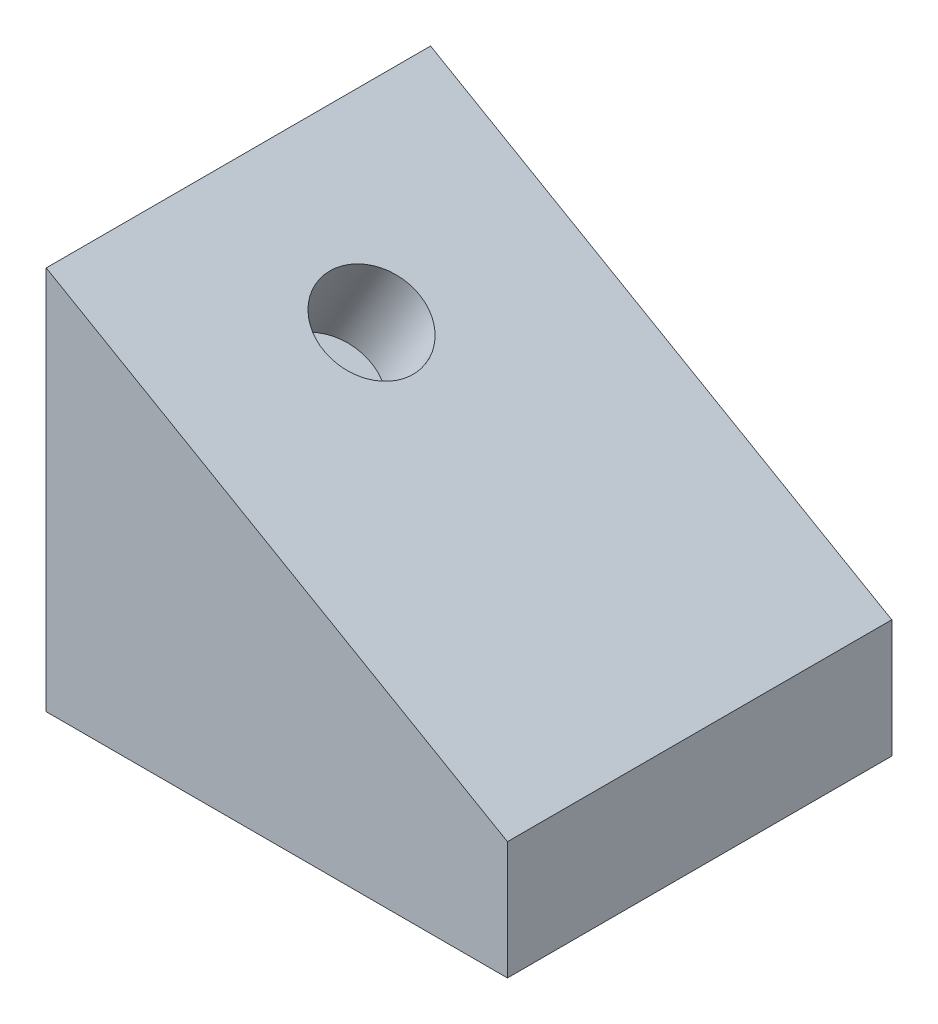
ISO-10303-21;
HEADER;
FILE_DESCRIPTION(('STEP AP214'),'2;1');
FILE_NAME('part.step','',(''),(''),'','','');
FILE_SCHEMA(('AUTOMOTIVE_DESIGN { 1 0 10303 214 1 1 1 1 }'));
ENDSEC;
DATA;
#1=APPLICATION_CONTEXT('core data for automotive mechanical design processes');
#2=APPLICATION_PROTOCOL_DEFINITION('international standard','automotive_design',2000,#1);
#3=PRODUCT_CONTEXT('',#1,'mechanical');
#4=PRODUCT('Part','Part','',(#3));
#5=PRODUCT_RELATED_PRODUCT_CATEGORY('part','',(#4));
#6=PRODUCT_DEFINITION_FORMATION('','',#4);
#7=PRODUCT_DEFINITION_CONTEXT('part definition',#1,'design');
#8=PRODUCT_DEFINITION('design','',#6,#7);
#9=PRODUCT_DEFINITION_SHAPE('','',#8);
#10=(LENGTH_UNIT() NAMED_UNIT(*) SI_UNIT(.MILLI.,.METRE.));
#11=(NAMED_UNIT(*) PLANE_ANGLE_UNIT() SI_UNIT($,.RADIAN.));
#12=(NAMED_UNIT(*) SI_UNIT($,.STERADIAN.) SOLID_ANGLE_UNIT());
#13=UNCERTAINTY_MEASURE_WITH_UNIT(LENGTH_MEASURE(1.E-05),#10,'distance_accuracy_value','');
#14=(GEOMETRIC_REPRESENTATION_CONTEXT(3) GLOBAL_UNCERTAINTY_ASSIGNED_CONTEXT((#13)) GLOBAL_UNIT_ASSIGNED_CONTEXT((#10,
#11,#12)) REPRESENTATION_CONTEXT('',''));
#15=CARTESIAN_POINT('',(0.,0.,0.));
#16=DIRECTION('',(0.,0.,1.));
#17=DIRECTION('',(1.,0.,0.));
#18=AXIS2_PLACEMENT_3D('',#15,#16,#17);
#19=CARTESIAN_POINT('',(24.,0.,10.));
#20=DIRECTION('',(0.,1.,0.));
#21=DIRECTION('',(-1.,0.,0.));
#22=AXIS2_PLACEMENT_3D('',#19,#20,#21);
#23=PLANE('',#22);
#24=CARTESIAN_POINT('',(14.,0.,0.));
#25=DIRECTION('',(0.,-1.,0.));
#26=DIRECTION('',(1.,0.,0.));
#27=AXIS2_PLACEMENT_3D('',#24,#25,#26);
#28=CIRCLE('',#27,2.5);
#29=CARTESIAN_POINT('',(16.5,0.,0.));
#30=VERTEX_POINT('',#29);
#31=EDGE_CURVE('E110',#30,#30,#28,.T.);
#32=ORIENTED_EDGE('',*,*,#31,.F.);
#33=EDGE_LOOP('',(#32));
#34=FACE_BOUND('',#33,.T.);
#35=DIRECTION('',(1.,0.,0.));
#36=VECTOR('',#35,1.);
#37=CARTESIAN_POINT('',(24.,0.,-10.));
#38=LINE('',#37,#36);
#39=CARTESIAN_POINT('',(0.,0.,-10.));
#40=VERTEX_POINT('',#39);
#41=CARTESIAN_POINT('',(24.,0.,-10.));
#42=VERTEX_POINT('',#41);
#43=EDGE_CURVE('E96',#40,#42,#38,.T.);
#44=ORIENTED_EDGE('',*,*,#43,.T.);
#45=DIRECTION('',(0.,0.,-1.));
#46=VECTOR('',#45,1.);
#47=CARTESIAN_POINT('',(24.,0.,10.));
#48=LINE('',#47,#46);
#49=CARTESIAN_POINT('',(24.,0.,10.));
#50=VERTEX_POINT('',#49);
#51=EDGE_CURVE('E11',#50,#42,#48,.T.);
#52=ORIENTED_EDGE('',*,*,#51,.F.);
#53=DIRECTION('',(1.,0.,0.));
#54=VECTOR('',#53,1.);
#55=CARTESIAN_POINT('',(24.,0.,10.));
#56=LINE('',#55,#54);
#57=CARTESIAN_POINT('',(0.,0.,10.));
#58=VERTEX_POINT('',#57);
#59=EDGE_CURVE('E84',#58,#50,#56,.T.);
#60=ORIENTED_EDGE('',*,*,#59,.F.);
#61=DIRECTION('',(0.,0.,-1.));
#62=VECTOR('',#61,1.);
#63=CARTESIAN_POINT('',(0.,0.,10.));
#64=LINE('',#63,#62);
#65=EDGE_CURVE('E92',#58,#40,#64,.T.);
#66=ORIENTED_EDGE('',*,*,#65,.T.);
#67=EDGE_LOOP('',(#44,#52,#60,#66));
#68=FACE_BOUND('',#67,.T.);
#69=ADVANCED_FACE('F33',(#34,#68),#23,.F.);
#70=CARTESIAN_POINT('',(24.,6.14359353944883,10.));
#71=DIRECTION('',(-1.,0.,0.));
#72=DIRECTION('',(0.,0.,1.));
#73=AXIS2_PLACEMENT_3D('',#70,#71,#72);
#74=PLANE('',#73);
#75=DIRECTION('',(0.,1.,0.));
#76=VECTOR('',#75,1.);
#77=CARTESIAN_POINT('',(24.,6.14359353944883,-10.));
#78=LINE('',#77,#76);
#79=CARTESIAN_POINT('',(24.,6.14359353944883,-10.));
#80=VERTEX_POINT('',#79);
#81=EDGE_CURVE('E88',#42,#80,#78,.T.);
#82=ORIENTED_EDGE('',*,*,#81,.T.);
#83=DIRECTION('',(0.,0.,-1.));
#84=VECTOR('',#83,1.);
#85=CARTESIAN_POINT('',(24.,6.14359353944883,10.));
#86=LINE('',#85,#84);
#87=CARTESIAN_POINT('',(24.,6.14359353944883,10.));
#88=VERTEX_POINT('',#87);
#89=EDGE_CURVE('E41',#88,#80,#86,.T.);
#90=ORIENTED_EDGE('',*,*,#89,.F.);
#91=DIRECTION('',(0.,1.,0.));
#92=VECTOR('',#91,1.);
#93=CARTESIAN_POINT('',(24.,6.14359353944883,10.));
#94=LINE('',#93,#92);
#95=EDGE_CURVE('E79',#50,#88,#94,.T.);
#96=ORIENTED_EDGE('',*,*,#95,.F.);
#97=ORIENTED_EDGE('',*,*,#51,.T.);
#98=EDGE_LOOP('',(#82,#90,#96,#97));
#99=FACE_BOUND('',#98,.T.);
#100=ADVANCED_FACE('F87',(#99),#74,.F.);
#101=CARTESIAN_POINT('',(0.,20.,10.));
#102=DIRECTION('',(-0.500000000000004,-0.866025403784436,0.));
#103=DIRECTION('',(0.866025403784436,-0.500000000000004,0.));
#104=AXIS2_PLACEMENT_3D('',#101,#102,#103);
#105=PLANE('',#104);
#106=CARTESIAN_POINT('',(6.92820323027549,16.,0.));
#107=DIRECTION('',(0.500000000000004,0.866025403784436,0.));
#108=DIRECTION('',(-0.866025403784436,0.500000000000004,0.));
#109=AXIS2_PLACEMENT_3D('',#106,#107,#108);
#110=CIRCLE('',#109,2.5);
#111=CARTESIAN_POINT('',(4.7631397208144,17.25,0.));
#112=VERTEX_POINT('',#111);
#113=EDGE_CURVE('E116',#112,#112,#110,.T.);
#114=ORIENTED_EDGE('',*,*,#113,.F.);
#115=EDGE_LOOP('',(#114));
#116=FACE_BOUND('',#115,.T.);
#117=DIRECTION('',(-0.866025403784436,0.500000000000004,0.));
#118=VECTOR('',#117,1.);
#119=CARTESIAN_POINT('',(0.,20.,-10.));
#120=LINE('',#119,#118);
#121=CARTESIAN_POINT('',(0.,20.,-10.));
#122=VERTEX_POINT('',#121);
#123=EDGE_CURVE('E66',#80,#122,#120,.T.);
#124=ORIENTED_EDGE('',*,*,#123,.T.);
#125=DIRECTION('',(0.,0.,-1.));
#126=VECTOR('',#125,1.);
#127=CARTESIAN_POINT('',(0.,20.,10.));
#128=LINE('',#127,#126);
#129=CARTESIAN_POINT('',(0.,20.,10.));
#130=VERTEX_POINT('',#129);
#131=EDGE_CURVE('E89',#130,#122,#128,.T.);
#132=ORIENTED_EDGE('',*,*,#131,.F.);
#133=DIRECTION('',(-0.866025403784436,0.500000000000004,0.));
#134=VECTOR('',#133,1.);
#135=CARTESIAN_POINT('',(0.,20.,10.));
#136=LINE('',#135,#134);
#137=EDGE_CURVE('E82',#88,#130,#136,.T.);
#138=ORIENTED_EDGE('',*,*,#137,.F.);
#139=ORIENTED_EDGE('',*,*,#89,.T.);
#140=EDGE_LOOP('',(#124,#132,#138,#139));
#141=FACE_BOUND('',#140,.T.);
#142=ADVANCED_FACE('F90',(#116,#141),#105,.F.);
#143=CARTESIAN_POINT('',(0.,0.,10.));
#144=DIRECTION('',(1.,0.,0.));
#145=DIRECTION('',(0.,0.,-1.));
#146=AXIS2_PLACEMENT_3D('',#143,#144,#145);
#147=PLANE('',#146);
#148=DIRECTION('',(0.,-1.,0.));
#149=VECTOR('',#148,1.);
#150=CARTESIAN_POINT('',(0.,0.,-10.));
#151=LINE('',#150,#149);
#152=EDGE_CURVE('E72',#122,#40,#151,.T.);
#153=ORIENTED_EDGE('',*,*,#152,.T.);
#154=ORIENTED_EDGE('',*,*,#65,.F.);
#155=DIRECTION('',(0.,-1.,0.));
#156=VECTOR('',#155,1.);
#157=CARTESIAN_POINT('',(0.,0.,10.));
#158=LINE('',#157,#156);
#159=EDGE_CURVE('E49',#130,#58,#158,.T.);
#160=ORIENTED_EDGE('',*,*,#159,.F.);
#161=ORIENTED_EDGE('',*,*,#131,.T.);
#162=EDGE_LOOP('',(#153,#154,#160,#161));
#163=FACE_BOUND('',#162,.T.);
#164=ADVANCED_FACE('F104',(#163),#147,.F.);
#165=CARTESIAN_POINT('',(0.,0.,10.));
#166=DIRECTION('',(0.,0.,-1.));
#167=DIRECTION('',(-1.,0.,0.));
#168=AXIS2_PLACEMENT_3D('',#165,#166,#167);
#169=PLANE('',#168);
#170=ORIENTED_EDGE('',*,*,#59,.T.);
#171=ORIENTED_EDGE('',*,*,#95,.T.);
#172=ORIENTED_EDGE('',*,*,#137,.T.);
#173=ORIENTED_EDGE('',*,*,#159,.T.);
#174=EDGE_LOOP('',(#170,#171,#172,#173));
#175=FACE_BOUND('',#174,.T.);
#176=ADVANCED_FACE('F80',(#175),#169,.F.);
#177=CARTESIAN_POINT('',(0.,0.,-10.));
#178=DIRECTION('',(0.,0.,-1.));
#179=DIRECTION('',(-1.,0.,0.));
#180=AXIS2_PLACEMENT_3D('',#177,#178,#179);
#181=PLANE('',#180);
#182=ORIENTED_EDGE('',*,*,#43,.F.);
#183=ORIENTED_EDGE('',*,*,#152,.F.);
#184=ORIENTED_EDGE('',*,*,#123,.F.);
#185=ORIENTED_EDGE('',*,*,#81,.F.);
#186=EDGE_LOOP('',(#182,#183,#184,#185));
#187=FACE_BOUND('',#186,.T.);
#188=ADVANCED_FACE('F107',(#187),#181,.T.);
#189=CARTESIAN_POINT('',(14.,5.,0.));
#190=DIRECTION('',(0.,-1.,0.));
#191=DIRECTION('',(1.,0.,0.));
#192=AXIS2_PLACEMENT_3D('',#189,#190,#191);
#193=CYLINDRICAL_SURFACE('',#192,2.5);
#194=CARTESIAN_POINT('',(14.,5.,0.));
#195=DIRECTION('',(0.,-1.,0.));
#196=DIRECTION('',(1.,0.,0.));
#197=AXIS2_PLACEMENT_3D('',#194,#195,#196);
#198=CIRCLE('',#197,2.5);
#199=CARTESIAN_POINT('',(16.5,5.,0.));
#200=VERTEX_POINT('',#199);
#201=EDGE_CURVE('E99',#200,#200,#198,.T.);
#202=ORIENTED_EDGE('',*,*,#201,.F.);
#203=EDGE_LOOP('',(#202));
#204=FACE_BOUND('',#203,.T.);
#205=ORIENTED_EDGE('',*,*,#31,.T.);
#206=EDGE_LOOP('',(#205));
#207=FACE_BOUND('',#206,.T.);
#208=ADVANCED_FACE('F144',(#204,#207),#193,.F.);
#209=CARTESIAN_POINT('',(14.,5.,0.));
#210=DIRECTION('',(0.,-1.,0.));
#211=DIRECTION('',(1.,0.,0.));
#212=AXIS2_PLACEMENT_3D('',#209,#210,#211);
#213=PLANE('',#212);
#214=ORIENTED_EDGE('',*,*,#201,.T.);
#215=EDGE_LOOP('',(#214));
#216=FACE_BOUND('',#215,.T.);
#217=ADVANCED_FACE('F127',(#216),#213,.T.);
#218=CARTESIAN_POINT('',(4.42820323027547,11.6698729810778,0.));
#219=DIRECTION('',(0.500000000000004,0.866025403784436,0.));
#220=DIRECTION('',(-0.866025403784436,0.500000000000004,0.));
#221=AXIS2_PLACEMENT_3D('',#218,#219,#220);
#222=CYLINDRICAL_SURFACE('',#221,2.5);
#223=CARTESIAN_POINT('',(4.42820323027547,11.6698729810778,0.));
#224=DIRECTION('',(0.500000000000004,0.866025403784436,0.));
#225=DIRECTION('',(-0.866025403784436,0.500000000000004,0.));
#226=AXIS2_PLACEMENT_3D('',#223,#224,#225);
#227=CIRCLE('',#226,2.5);
#228=CARTESIAN_POINT('',(2.26313972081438,12.9198729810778,0.));
#229=VERTEX_POINT('',#228);
#230=EDGE_CURVE('E113',#229,#229,#227,.T.);
#231=CARTESIAN_POINT('',(2.26313972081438,12.9198729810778,0.));
#232=CARTESIAN_POINT('',(2.28918138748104,12.9649784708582,0.));
#233=CARTESIAN_POINT('',(2.31522305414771,13.0100839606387,0.));
#234=CARTESIAN_POINT('',(2.36730638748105,13.1002949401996,0.));
#235=CARTESIAN_POINT('',(2.39334805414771,13.14540042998,0.));
#236=CARTESIAN_POINT('',(2.44543138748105,13.2356114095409,0.));
#237=CARTESIAN_POINT('',(2.47147305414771,13.2807168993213,0.));
#238=CARTESIAN_POINT('',(2.52355638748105,13.3709278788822,0.));
#239=CARTESIAN_POINT('',(2.54959805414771,13.4160333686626,0.));
#240=CARTESIAN_POINT('',(2.60168138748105,13.5062443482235,0.));
#241=CARTESIAN_POINT('',(2.62772305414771,13.551349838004,0.));
#242=CARTESIAN_POINT('',(2.67980638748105,13.6415608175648,0.));
#243=CARTESIAN_POINT('',(2.70584805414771,13.6866663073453,0.));
#244=CARTESIAN_POINT('',(2.75793138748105,13.7768772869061,0.));
#245=CARTESIAN_POINT('',(2.78397305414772,13.8219827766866,0.));
#246=CARTESIAN_POINT('',(2.83605638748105,13.9121937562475,0.));
#247=CARTESIAN_POINT('',(2.86209805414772,13.9572992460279,0.));
#248=CARTESIAN_POINT('',(2.91418138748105,14.0475102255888,0.));
#249=CARTESIAN_POINT('',(2.94022305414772,14.0926157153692,0.));
#250=CARTESIAN_POINT('',(2.99230638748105,14.1828266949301,0.));
#251=CARTESIAN_POINT('',(3.01834805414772,14.2279321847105,0.));
#252=CARTESIAN_POINT('',(3.07043138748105,14.3181431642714,0.));
#253=CARTESIAN_POINT('',(3.09647305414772,14.3632486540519,0.));
#254=CARTESIAN_POINT('',(3.14855638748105,14.4534596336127,0.));
#255=CARTESIAN_POINT('',(3.17459805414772,14.4985651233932,0.));
#256=CARTESIAN_POINT('',(3.22668138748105,14.5887761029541,0.));
#257=CARTESIAN_POINT('',(3.25272305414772,14.6338815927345,0.));
#258=CARTESIAN_POINT('',(3.30480638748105,14.7240925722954,0.));
#259=CARTESIAN_POINT('',(3.33084805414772,14.7691980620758,0.));
#260=CARTESIAN_POINT('',(3.38293138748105,14.8594090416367,0.));
#261=CARTESIAN_POINT('',(3.40897305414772,14.9045145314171,0.));
#262=CARTESIAN_POINT('',(3.46105638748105,14.994725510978,0.));
#263=CARTESIAN_POINT('',(3.48709805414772,15.0398310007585,0.));
#264=CARTESIAN_POINT('',(3.53918138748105,15.1300419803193,0.));
#265=CARTESIAN_POINT('',(3.56522305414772,15.1751474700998,0.));
#266=CARTESIAN_POINT('',(3.61730638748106,15.2653584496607,0.));
#267=CARTESIAN_POINT('',(3.64334805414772,15.3104639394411,0.));
#268=CARTESIAN_POINT('',(3.69543138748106,15.400674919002,0.));
#269=CARTESIAN_POINT('',(3.72147305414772,15.4457804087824,0.));
#270=CARTESIAN_POINT('',(3.77355638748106,15.5359913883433,0.));
#271=CARTESIAN_POINT('',(3.79959805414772,15.5810968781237,0.));
#272=CARTESIAN_POINT('',(3.85168138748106,15.6713078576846,0.));
#273=CARTESIAN_POINT('',(3.87772305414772,15.716413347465,0.));
#274=CARTESIAN_POINT('',(3.92980638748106,15.8066243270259,0.));
#275=CARTESIAN_POINT('',(3.95584805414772,15.8517298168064,0.));
#276=CARTESIAN_POINT('',(4.00793138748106,15.9419407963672,0.));
#277=CARTESIAN_POINT('',(4.03397305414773,15.9870462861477,0.));
#278=CARTESIAN_POINT('',(4.08605638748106,16.0772572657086,0.));
#279=CARTESIAN_POINT('',(4.11209805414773,16.122362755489,0.));
#280=CARTESIAN_POINT('',(4.16418138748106,16.2125737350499,0.));
#281=CARTESIAN_POINT('',(4.19022305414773,16.2576792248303,0.));
#282=CARTESIAN_POINT('',(4.24230638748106,16.3478902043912,0.));
#283=CARTESIAN_POINT('',(4.26834805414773,16.3929956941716,0.));
#284=CARTESIAN_POINT('',(4.32043138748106,16.4832066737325,0.));
#285=CARTESIAN_POINT('',(4.34647305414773,16.528312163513,0.));
#286=CARTESIAN_POINT('',(4.39855638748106,16.6185231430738,0.));
#287=CARTESIAN_POINT('',(4.42459805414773,16.6636286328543,0.));
#288=CARTESIAN_POINT('',(4.47668138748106,16.7538396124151,0.));
#289=CARTESIAN_POINT('',(4.50272305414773,16.7989451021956,0.));
#290=CARTESIAN_POINT('',(4.55480638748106,16.8891560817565,0.));
#291=CARTESIAN_POINT('',(4.58084805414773,16.9342615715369,0.));
#292=CARTESIAN_POINT('',(4.63293138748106,17.0244725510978,0.));
#293=CARTESIAN_POINT('',(4.65897305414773,17.0695780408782,0.));
#294=CARTESIAN_POINT('',(4.71105638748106,17.1597890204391,0.));
#295=CARTESIAN_POINT('',(4.73709805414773,17.2048945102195,0.));
#296=CARTESIAN_POINT('',(4.7631397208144,17.25,0.));
#297=B_SPLINE_CURVE_WITH_KNOTS('',3,(#231,#232,#233,#234,#235,#236,#237,#238,#239,#240,#241,
#242,#243,#244,#245,#246,#247,#248,#249,#250,#251,#252,#253,#254,#255,#256,#257,#258,#259,#260,
#261,#262,#263,#264,#265,#266,#267,#268,#269,#270,#271,#272,#273,#274,#275,#276,#277,#278,#279,
#280,#281,#282,#283,#284,#285,#286,#287,#288,#289,#290,#291,#292,#293,#294,#295,#296),
.UNSPECIFIED.,.F.,.F.,(4,2,2,2,2,2,2,2,2,2,2,2,2,2,2,2,2,2,2,2,2,2,2,2,2,2,2,2,2,2,2,2,4),(0.,
0.156249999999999,0.312499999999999,0.46875,0.624999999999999,0.78125,0.937499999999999,1.09375,
1.25,1.40625,1.5625,1.71875,1.875,2.03125,2.1875,2.34375,2.5,2.65625,2.8125,2.96875,3.125,
3.28125,3.4375,3.59375,3.75,3.90625,4.0625,4.21875,4.375,4.53125,4.6875,4.84375,5.),.UNSPECIFIED.);
#298=EDGE_CURVE('BSEAM124',#229,#112,#297,.T.);
#299=ORIENTED_EDGE('',*,*,#230,.F.);
#300=ORIENTED_EDGE('',*,*,#113,.T.);
#301=ORIENTED_EDGE('',*,*,#298,.T.);
#302=ORIENTED_EDGE('',*,*,#298,.F.);
#303=EDGE_LOOP('',(#299,#301,#300,#302));
#304=FACE_BOUND('',#303,.T.);
#305=ADVANCED_FACE('F124',(#304),#222,.F.);
#306=CARTESIAN_POINT('',(4.42820323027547,11.6698729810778,0.));
#307=DIRECTION('',(0.500000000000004,0.866025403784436,0.));
#308=DIRECTION('',(-0.866025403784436,0.500000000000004,0.));
#309=AXIS2_PLACEMENT_3D('',#306,#307,#308);
#310=PLANE('',#309);
#311=ORIENTED_EDGE('',*,*,#230,.T.);
#312=EDGE_LOOP('',(#311));
#313=FACE_BOUND('',#312,.T.);
#314=ADVANCED_FACE('F122',(#313),#310,.T.);
#315=CLOSED_SHELL('',(#69,#100,#142,#164,#176,#188,#208,#217,#305,#314));
#316=MANIFOLD_SOLID_BREP('B2',#315);
#317=ADVANCED_BREP_SHAPE_REPRESENTATION('',(#18,#316),#14);
#318=SHAPE_DEFINITION_REPRESENTATION(#9,#317);
ENDSEC;
END-ISO-10303-21;
